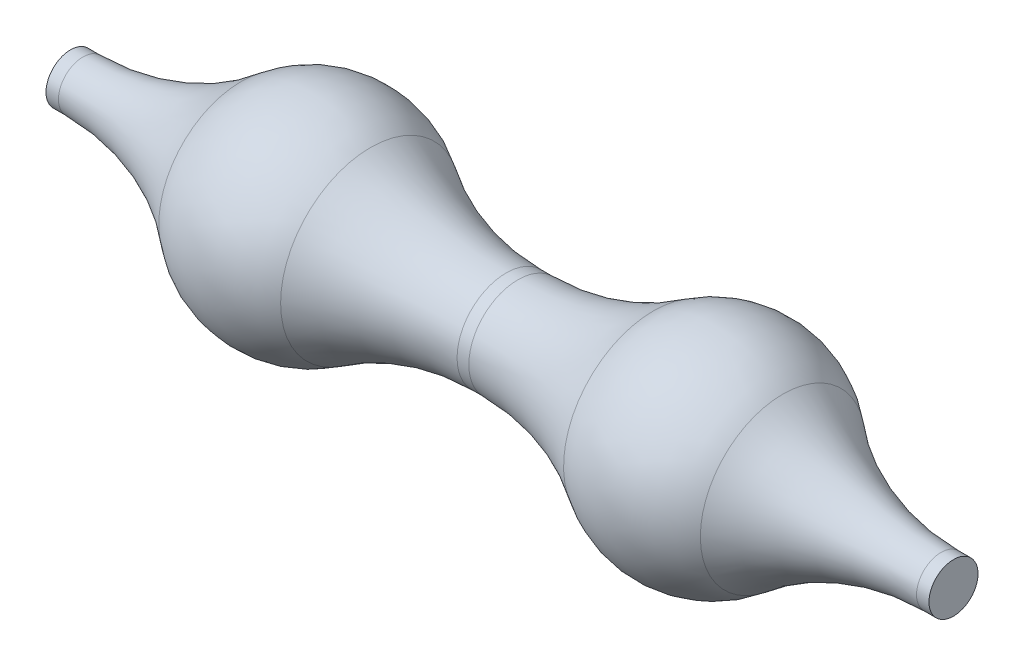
ISO-10303-21;
HEADER;
FILE_DESCRIPTION(('STEP AP214'),'2;1');
FILE_NAME('part.step','',(''),(''),'','','');
FILE_SCHEMA(('AUTOMOTIVE_DESIGN { 1 0 10303 214 1 1 1 1 }'));
ENDSEC;
DATA;
#1=APPLICATION_CONTEXT('core data for automotive mechanical design processes');
#2=APPLICATION_PROTOCOL_DEFINITION('international standard','automotive_design',2000,#1);
#3=PRODUCT_CONTEXT('',#1,'mechanical');
#4=PRODUCT('Part','Part','',(#3));
#5=PRODUCT_RELATED_PRODUCT_CATEGORY('part','',(#4));
#6=PRODUCT_DEFINITION_FORMATION('','',#4);
#7=PRODUCT_DEFINITION_CONTEXT('part definition',#1,'design');
#8=PRODUCT_DEFINITION('design','',#6,#7);
#9=PRODUCT_DEFINITION_SHAPE('','',#8);
#10=(LENGTH_UNIT() NAMED_UNIT(*) SI_UNIT(.MILLI.,.METRE.));
#11=(NAMED_UNIT(*) PLANE_ANGLE_UNIT() SI_UNIT($,.RADIAN.));
#12=(NAMED_UNIT(*) SI_UNIT($,.STERADIAN.) SOLID_ANGLE_UNIT());
#13=UNCERTAINTY_MEASURE_WITH_UNIT(LENGTH_MEASURE(1.E-05),#10,'distance_accuracy_value','');
#14=(GEOMETRIC_REPRESENTATION_CONTEXT(3) GLOBAL_UNCERTAINTY_ASSIGNED_CONTEXT((#13)) GLOBAL_UNIT_ASSIGNED_CONTEXT((#10,
#11,#12)) REPRESENTATION_CONTEXT('',''));
#15=CARTESIAN_POINT('',(0.,0.,0.));
#16=DIRECTION('',(0.,0.,1.));
#17=DIRECTION('',(1.,0.,0.));
#18=AXIS2_PLACEMENT_3D('',#15,#16,#17);
#19=CARTESIAN_POINT('',(7.65,0.,0.));
#20=DIRECTION('',(-1.,0.,0.));
#21=DIRECTION('',(0.,0.,1.));
#22=AXIS2_PLACEMENT_3D('',#19,#20,#21);
#23=PLANE('',#22);
#24=CARTESIAN_POINT('',(7.65,0.,0.));
#25=DIRECTION('',(-1.,0.,0.));
#26=DIRECTION('',(0.,0.,1.));
#27=AXIS2_PLACEMENT_3D('',#24,#25,#26);
#28=CIRCLE('',#27,0.25);
#29=CARTESIAN_POINT('',(7.65,0.,0.25));
#30=VERTEX_POINT('',#29);
#31=EDGE_CURVE('E65',#30,#30,#28,.T.);
#32=ORIENTED_EDGE('',*,*,#31,.F.);
#33=EDGE_LOOP('',(#32));
#34=FACE_BOUND('',#33,.T.);
#35=ADVANCED_FACE('F34',(#34),#23,.F.);
#36=CARTESIAN_POINT('',(-1.35,0.,0.));
#37=DIRECTION('',(-1.,0.,0.));
#38=DIRECTION('',(0.,0.,1.));
#39=AXIS2_PLACEMENT_3D('',#36,#37,#38);
#40=CYLINDRICAL_SURFACE('',#39,0.25);
#41=CARTESIAN_POINT('',(7.52325203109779,0.,0.));
#42=DIRECTION('',(-1.,0.,0.));
#43=DIRECTION('',(0.,0.,1.));
#44=AXIS2_PLACEMENT_3D('',#41,#42,#43);
#45=CIRCLE('',#44,0.25);
#46=CARTESIAN_POINT('',(7.52325203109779,0.,0.25));
#47=VERTEX_POINT('',#46);
#48=EDGE_CURVE('E11',#47,#47,#45,.F.);
#49=ORIENTED_EDGE('',*,*,#48,.T.);
#50=EDGE_LOOP('',(#49));
#51=FACE_BOUND('',#50,.T.);
#52=ORIENTED_EDGE('',*,*,#31,.T.);
#53=EDGE_LOOP('',(#52));
#54=FACE_BOUND('',#53,.T.);
#55=ADVANCED_FACE('F89',(#51,#54),#40,.T.);
#56=CARTESIAN_POINT('',(5.2,0.,0.));
#57=DIRECTION('',(-1.,0.,0.));
#58=DIRECTION('',(0.,1.,0.));
#59=AXIS2_PLACEMENT_3D('',#56,#57,#58);
#60=SPHERICAL_SURFACE('',#59,1.1);
#61=CARTESIAN_POINT('',(4.59195212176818,0.,0.));
#62=DIRECTION('',(1.,0.,0.));
#63=DIRECTION('',(0.,0.,-1.));
#64=AXIS2_PLACEMENT_3D('',#61,#62,#63);
#65=CIRCLE('',#64,0.916666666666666);
#66=CARTESIAN_POINT('',(4.59195212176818,0.916666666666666,0.));
#67=VERTEX_POINT('',#66);
#68=EDGE_CURVE('E40',#67,#67,#65,.T.);
#69=CARTESIAN_POINT('',(5.90988256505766,0.,0.));
#70=DIRECTION('',(-1.,0.,0.));
#71=DIRECTION('',(0.,0.,1.));
#72=AXIS2_PLACEMENT_3D('',#69,#70,#71);
#73=CIRCLE('',#72,0.840277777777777);
#74=CARTESIAN_POINT('',(5.90988256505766,0.840277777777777,0.));
#75=VERTEX_POINT('',#74);
#76=EDGE_CURVE('E44',#75,#75,#73,.T.);
#77=CARTESIAN_POINT('',(4.59195212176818,0.916666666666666,0.));
#78=CARTESIAN_POINT('',(4.60424266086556,0.924819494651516,0.));
#79=CARTESIAN_POINT('',(4.6166973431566,0.932724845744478,0.));
#80=CARTESIAN_POINT('',(4.64191445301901,0.948028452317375,0.));
#81=CARTESIAN_POINT('',(4.65467688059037,0.95542670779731,0.));
#82=CARTESIAN_POINT('',(4.6804889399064,0.969703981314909,0.));
#83=CARTESIAN_POINT('',(4.69353857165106,0.976582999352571,0.));
#84=CARTESIAN_POINT('',(4.71990390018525,0.989810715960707,0.));
#85=CARTESIAN_POINT('',(4.73321959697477,0.996159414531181,0.));
#86=CARTESIAN_POINT('',(4.76009552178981,1.00831620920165,0.));
#87=CARTESIAN_POINT('',(4.77365574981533,1.01412430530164,0.));
#88=CARTESIAN_POINT('',(4.80099879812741,1.02519050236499,0.));
#89=CARTESIAN_POINT('',(4.81478161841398,1.03044860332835,0.));
#90=CARTESIAN_POINT('',(4.84254755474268,1.04040630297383,0.));
#91=CARTESIAN_POINT('',(4.85653067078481,1.04510590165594,0.));
#92=CARTESIAN_POINT('',(4.88467457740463,1.05393899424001,0.));
#93=CARTESIAN_POINT('',(4.89883536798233,1.05807248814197,0.));
#94=CARTESIAN_POINT('',(4.92731171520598,1.06576668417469,0.));
#95=CARTESIAN_POINT('',(4.94162727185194,1.06932738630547,0.));
#96=CARTESIAN_POINT('',(4.97038999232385,1.0758702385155,0.));
#97=CARTESIAN_POINT('',(4.98483715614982,1.07885238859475,0.));
#98=CARTESIAN_POINT('',(5.01383971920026,1.08423331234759,0.));
#99=CARTESIAN_POINT('',(5.02839511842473,1.08663208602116,0.));
#100=CARTESIAN_POINT('',(5.05759060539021,1.09084237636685,0.));
#101=CARTESIAN_POINT('',(5.07223069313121,1.09265389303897,0.));
#102=CARTESIAN_POINT('',(5.10157187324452,1.09568673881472,0.));
#103=CARTESIAN_POINT('',(5.11627296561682,1.09690806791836,0.));
#104=CARTESIAN_POINT('',(5.14571237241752,1.09875856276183,0.));
#105=CARTESIAN_POINT('',(5.16045068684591,1.09938772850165,0.));
#106=CARTESIAN_POINT('',(5.18994069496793,1.10005287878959,0.));
#107=CARTESIAN_POINT('',(5.20469238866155,1.1000888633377,0.));
#108=CARTESIAN_POINT('',(5.23418529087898,1.09956759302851,0.));
#109=CARTESIAN_POINT('',(5.24892649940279,1.0990103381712,0.));
#110=CARTESIAN_POINT('',(5.27837458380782,1.09730349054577,0.));
#111=CARTESIAN_POINT('',(5.29308145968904,1.09615389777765,0.));
#112=CARTESIAN_POINT('',(5.32243708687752,1.09326423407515,0.));
#113=CARTESIAN_POINT('',(5.33708583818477,1.09152416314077,0.));
#114=CARTESIAN_POINT('',(5.36630151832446,1.08745635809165,0.));
#115=CARTESIAN_POINT('',(5.38086844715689,1.08512862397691,0.));
#116=CARTESIAN_POINT('',(5.4098969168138,1.07988925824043,0.));
#117=CARTESIAN_POINT('',(5.42435845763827,1.07697762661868,0.));
#118=CARTESIAN_POINT('',(5.45315275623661,1.07057517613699,0.));
#119=CARTESIAN_POINT('',(5.46748551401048,1.06708435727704,0.));
#120=CARTESIAN_POINT('',(5.49599905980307,1.05952917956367,0.));
#121=CARTESIAN_POINT('',(5.51017984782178,1.05546482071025,0.));
#122=CARTESIAN_POINT('',(5.5383665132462,1.04676913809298,0.));
#123=CARTESIAN_POINT('',(5.55237239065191,1.04213781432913,0.));
#124=CARTESIAN_POINT('',(5.58018657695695,1.03231569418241,0.));
#125=CARTESIAN_POINT('',(5.59399488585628,1.02712489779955,0.));
#126=CARTESIAN_POINT('',(5.62139159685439,1.01619222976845,0.));
#127=CARTESIAN_POINT('',(5.63497999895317,1.01045035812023,0.));
#128=CARTESIAN_POINT('',(5.66191491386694,0.998424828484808,0.));
#129=CARTESIAN_POINT('',(5.67526142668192,0.992141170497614,0.));
#130=CARTESIAN_POINT('',(5.70169097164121,0.979042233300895,0.));
#131=CARTESIAN_POINT('',(5.71477400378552,0.97222695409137,0.));
#132=CARTESIAN_POINT('',(5.74065542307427,0.958075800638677,0.));
#133=CARTESIAN_POINT('',(5.75345381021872,0.95073992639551,0.));
#134=CARTESIAN_POINT('',(5.77874523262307,0.935559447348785,0.));
#135=CARTESIAN_POINT('',(5.79123826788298,0.927714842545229,0.));
#136=CARTESIAN_POINT('',(5.81589878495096,0.911529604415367,0.));
#137=CARTESIAN_POINT('',(5.82806626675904,0.903188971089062,0.));
#138=CARTESIAN_POINT('',(5.85205595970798,0.886025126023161,0.));
#139=CARTESIAN_POINT('',(5.86387817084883,0.877201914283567,0.));
#140=CARTESIAN_POINT('',(5.88715832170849,0.859087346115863,0.));
#141=CARTESIAN_POINT('',(5.89861626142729,0.849795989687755,0.));
#142=CARTESIAN_POINT('',(5.90988256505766,0.840277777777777,0.));
#143=B_SPLINE_CURVE_WITH_KNOTS('',3,(#77,#78,#79,#80,#81,#82,#83,#84,#85,#86,#87,#88,#89,#90,
#91,#92,#93,#94,#95,#96,#97,#98,#99,#100,#101,#102,#103,#104,#105,#106,#107,#108,#109,#110,#111,
#112,#113,#114,#115,#116,#117,#118,#119,#120,#121,#122,#123,#124,#125,#126,#127,#128,#129,#130,
#131,#132,#133,#134,#135,#136,#137,#138,#139,#140,#141,#142),.UNSPECIFIED.,.F.,.F.,(4,2,2,2,2,2,
2,2,2,2,2,2,2,2,2,2,2,2,2,2,2,2,2,2,2,2,2,2,2,2,2,2,4),(0.,0.0442432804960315,
0.0884865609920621,0.132729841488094,0.176973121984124,0.221216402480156,0.265459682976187,
0.309702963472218,0.353946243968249,0.39818952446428,0.442432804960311,0.486676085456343,
0.530919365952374,0.575162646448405,0.619405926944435,0.663649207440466,0.707892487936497,
0.752135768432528,0.79637904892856,0.840622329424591,0.884865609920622,0.929108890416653,
0.973352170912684,1.01759545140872,1.06183873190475,1.10608201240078,1.15032529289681,
1.19456857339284,1.23881185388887,1.2830551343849,1.32729841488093,1.37154169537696,
1.41578497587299),.UNSPECIFIED.);
#144=EDGE_CURVE('BSEAM94',#67,#75,#143,.T.);
#145=ORIENTED_EDGE('',*,*,#68,.T.);
#146=ORIENTED_EDGE('',*,*,#76,.T.);
#147=ORIENTED_EDGE('',*,*,#144,.T.);
#148=ORIENTED_EDGE('',*,*,#144,.F.);
#149=EDGE_LOOP('',(#145,#147,#146,#148));
#150=FACE_BOUND('',#149,.T.);
#151=ADVANCED_FACE('F94',(#150),#60,.T.);
#152=CARTESIAN_POINT('',(-1.35,0.,0.));
#153=DIRECTION('',(-1.,0.,0.));
#154=DIRECTION('',(0.,0.,1.));
#155=AXIS2_PLACEMENT_3D('',#152,#153,#154);
#156=CYLINDRICAL_SURFACE('',#155,0.5);
#157=CARTESIAN_POINT('',(3.21002512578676,0.,0.));
#158=DIRECTION('',(1.,0.,0.));
#159=DIRECTION('',(0.,0.,-1.));
#160=AXIS2_PLACEMENT_3D('',#157,#158,#159);
#161=CIRCLE('',#160,0.5);
#162=CARTESIAN_POINT('',(3.21002512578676,0.,-0.5));
#163=VERTEX_POINT('',#162);
#164=EDGE_CURVE('E48',#163,#163,#161,.F.);
#165=ORIENTED_EDGE('',*,*,#164,.T.);
#166=EDGE_LOOP('',(#165));
#167=FACE_BOUND('',#166,.T.);
#168=CARTESIAN_POINT('',(3.08997487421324,0.,0.));
#169=DIRECTION('',(-1.,0.,0.));
#170=DIRECTION('',(0.,0.,1.));
#171=AXIS2_PLACEMENT_3D('',#168,#169,#170);
#172=CIRCLE('',#171,0.5);
#173=CARTESIAN_POINT('',(3.08997487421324,0.,0.5));
#174=VERTEX_POINT('',#173);
#175=EDGE_CURVE('E53',#174,#174,#172,.F.);
#176=ORIENTED_EDGE('',*,*,#175,.T.);
#177=EDGE_LOOP('',(#176));
#178=FACE_BOUND('',#177,.T.);
#179=ADVANCED_FACE('F85',(#167,#178),#156,.T.);
#180=CARTESIAN_POINT('',(1.1,0.,0.));
#181=DIRECTION('',(-1.,0.,0.));
#182=DIRECTION('',(0.,1.,0.));
#183=AXIS2_PLACEMENT_3D('',#180,#181,#182);
#184=SPHERICAL_SURFACE('',#183,1.1);
#185=CARTESIAN_POINT('',(0.390117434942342,0.,0.));
#186=DIRECTION('',(1.,0.,0.));
#187=DIRECTION('',(0.,0.,-1.));
#188=AXIS2_PLACEMENT_3D('',#185,#186,#187);
#189=CIRCLE('',#188,0.840277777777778);
#190=CARTESIAN_POINT('',(0.390117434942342,0.840277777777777,0.));
#191=VERTEX_POINT('',#190);
#192=EDGE_CURVE('E56',#191,#191,#189,.T.);
#193=CARTESIAN_POINT('',(1.70804787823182,0.,0.));
#194=DIRECTION('',(-1.,0.,0.));
#195=DIRECTION('',(0.,0.,1.));
#196=AXIS2_PLACEMENT_3D('',#193,#194,#195);
#197=CIRCLE('',#196,0.916666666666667);
#198=CARTESIAN_POINT('',(1.70804787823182,0.916666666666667,0.));
#199=VERTEX_POINT('',#198);
#200=EDGE_CURVE('E59',#199,#199,#197,.T.);
#201=CARTESIAN_POINT('',(0.390117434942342,0.840277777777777,0.));
#202=CARTESIAN_POINT('',(0.401383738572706,0.849795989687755,0.));
#203=CARTESIAN_POINT('',(0.412841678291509,0.859087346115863,0.));
#204=CARTESIAN_POINT('',(0.436121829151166,0.877201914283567,0.));
#205=CARTESIAN_POINT('',(0.44794404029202,0.886025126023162,0.));
#206=CARTESIAN_POINT('',(0.471933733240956,0.903188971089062,0.));
#207=CARTESIAN_POINT('',(0.484101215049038,0.911529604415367,0.));
#208=CARTESIAN_POINT('',(0.508761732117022,0.927714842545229,0.));
#209=CARTESIAN_POINT('',(0.521254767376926,0.935559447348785,0.));
#210=CARTESIAN_POINT('',(0.546546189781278,0.95073992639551,0.));
#211=CARTESIAN_POINT('',(0.559344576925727,0.958075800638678,0.));
#212=CARTESIAN_POINT('',(0.585225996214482,0.972226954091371,0.));
#213=CARTESIAN_POINT('',(0.598309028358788,0.979042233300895,0.));
#214=CARTESIAN_POINT('',(0.624738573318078,0.992141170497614,0.));
#215=CARTESIAN_POINT('',(0.638085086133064,0.998424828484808,0.));
#216=CARTESIAN_POINT('',(0.665020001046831,1.01045035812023,0.));
#217=CARTESIAN_POINT('',(0.678608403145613,1.01619222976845,0.));
#218=CARTESIAN_POINT('',(0.706005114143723,1.02712489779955,0.));
#219=CARTESIAN_POINT('',(0.719813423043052,1.03231569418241,0.));
#220=CARTESIAN_POINT('',(0.747627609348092,1.04213781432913,0.));
#221=CARTESIAN_POINT('',(0.761633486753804,1.04676913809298,0.));
#222=CARTESIAN_POINT('',(0.789820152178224,1.05546482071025,0.));
#223=CARTESIAN_POINT('',(0.804000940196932,1.05952917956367,0.));
#224=CARTESIAN_POINT('',(0.832514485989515,1.06708435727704,0.));
#225=CARTESIAN_POINT('',(0.846847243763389,1.07057517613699,0.));
#226=CARTESIAN_POINT('',(0.875641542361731,1.07697762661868,0.));
#227=CARTESIAN_POINT('',(0.8901030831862,1.07988925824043,0.));
#228=CARTESIAN_POINT('',(0.919131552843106,1.08512862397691,0.));
#229=CARTESIAN_POINT('',(0.933698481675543,1.08745635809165,0.));
#230=CARTESIAN_POINT('',(0.96291416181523,1.09152416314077,0.));
#231=CARTESIAN_POINT('',(0.977562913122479,1.09326423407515,0.));
#232=CARTESIAN_POINT('',(1.00691854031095,1.09615389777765,0.));
#233=CARTESIAN_POINT('',(1.02162541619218,1.09730349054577,0.));
#234=CARTESIAN_POINT('',(1.05107350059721,1.0990103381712,0.));
#235=CARTESIAN_POINT('',(1.06581470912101,1.09956759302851,0.));
#236=CARTESIAN_POINT('',(1.09530761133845,1.1000888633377,0.));
#237=CARTESIAN_POINT('',(1.11005930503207,1.10005287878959,0.));
#238=CARTESIAN_POINT('',(1.13954931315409,1.09938772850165,0.));
#239=CARTESIAN_POINT('',(1.15428762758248,1.09875856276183,0.));
#240=CARTESIAN_POINT('',(1.18372703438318,1.09690806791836,0.));
#241=CARTESIAN_POINT('',(1.19842812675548,1.09568673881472,0.));
#242=CARTESIAN_POINT('',(1.22776930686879,1.09265389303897,0.));
#243=CARTESIAN_POINT('',(1.24240939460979,1.09084237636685,0.));
#244=CARTESIAN_POINT('',(1.27160488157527,1.08663208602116,0.));
#245=CARTESIAN_POINT('',(1.28616028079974,1.08423331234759,0.));
#246=CARTESIAN_POINT('',(1.31516284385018,1.07885238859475,0.));
#247=CARTESIAN_POINT('',(1.32961000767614,1.0758702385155,0.));
#248=CARTESIAN_POINT('',(1.35837272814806,1.06932738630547,0.));
#249=CARTESIAN_POINT('',(1.37268828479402,1.06576668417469,0.));
#250=CARTESIAN_POINT('',(1.40116463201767,1.05807248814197,0.));
#251=CARTESIAN_POINT('',(1.41532542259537,1.05393899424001,0.));
#252=CARTESIAN_POINT('',(1.44346932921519,1.04510590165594,0.));
#253=CARTESIAN_POINT('',(1.45745244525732,1.04040630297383,0.));
#254=CARTESIAN_POINT('',(1.48521838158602,1.03044860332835,0.));
#255=CARTESIAN_POINT('',(1.49900120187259,1.02519050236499,0.));
#256=CARTESIAN_POINT('',(1.52634425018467,1.01412430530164,0.));
#257=CARTESIAN_POINT('',(1.53990447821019,1.00831620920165,0.));
#258=CARTESIAN_POINT('',(1.56678040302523,0.996159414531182,0.));
#259=CARTESIAN_POINT('',(1.58009609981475,0.989810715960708,0.));
#260=CARTESIAN_POINT('',(1.60646142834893,0.976582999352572,0.));
#261=CARTESIAN_POINT('',(1.6195110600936,0.969703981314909,0.));
#262=CARTESIAN_POINT('',(1.64532311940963,0.955426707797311,0.));
#263=CARTESIAN_POINT('',(1.65808554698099,0.948028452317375,0.));
#264=CARTESIAN_POINT('',(1.6833026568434,0.932724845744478,0.));
#265=CARTESIAN_POINT('',(1.69575733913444,0.924819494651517,0.));
#266=CARTESIAN_POINT('',(1.70804787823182,0.916666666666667,0.));
#267=B_SPLINE_CURVE_WITH_KNOTS('',3,(#201,#202,#203,#204,#205,#206,#207,#208,#209,#210,#211,
#212,#213,#214,#215,#216,#217,#218,#219,#220,#221,#222,#223,#224,#225,#226,#227,#228,#229,#230,
#231,#232,#233,#234,#235,#236,#237,#238,#239,#240,#241,#242,#243,#244,#245,#246,#247,#248,#249,
#250,#251,#252,#253,#254,#255,#256,#257,#258,#259,#260,#261,#262,#263,#264,#265,#266),
.UNSPECIFIED.,.F.,.F.,(4,2,2,2,2,2,2,2,2,2,2,2,2,2,2,2,2,2,2,2,2,2,2,2,2,2,2,2,2,2,2,2,4),(0.,
0.044243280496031,0.0884865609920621,0.132729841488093,0.176973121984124,0.221216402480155,
0.265459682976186,0.309702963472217,0.353946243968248,0.398189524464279,0.44243280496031,
0.486676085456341,0.530919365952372,0.575162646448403,0.619405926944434,0.663649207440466,
0.707892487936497,0.752135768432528,0.796379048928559,0.84062232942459,0.884865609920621,
0.929108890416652,0.973352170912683,1.01759545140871,1.06183873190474,1.10608201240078,
1.15032529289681,1.19456857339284,1.23881185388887,1.2830551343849,1.32729841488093,
1.37154169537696,1.41578497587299),.UNSPECIFIED.);
#268=EDGE_CURVE('BSEAM76',#191,#199,#267,.T.);
#269=ORIENTED_EDGE('',*,*,#192,.T.);
#270=ORIENTED_EDGE('',*,*,#200,.T.);
#271=ORIENTED_EDGE('',*,*,#268,.T.);
#272=ORIENTED_EDGE('',*,*,#268,.F.);
#273=EDGE_LOOP('',(#269,#271,#270,#272));
#274=FACE_BOUND('',#273,.T.);
#275=ADVANCED_FACE('F76',(#274),#184,.T.);
#276=CARTESIAN_POINT('',(-1.35,0.,0.));
#277=DIRECTION('',(-1.,0.,0.));
#278=DIRECTION('',(0.,0.,1.));
#279=AXIS2_PLACEMENT_3D('',#276,#277,#278);
#280=CYLINDRICAL_SURFACE('',#279,0.25);
#281=CARTESIAN_POINT('',(-1.22325203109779,0.,0.));
#282=DIRECTION('',(1.,0.,0.));
#283=DIRECTION('',(0.,0.,-1.));
#284=AXIS2_PLACEMENT_3D('',#281,#282,#283);
#285=CIRCLE('',#284,0.25);
#286=CARTESIAN_POINT('',(-1.22325203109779,0.,-0.25));
#287=VERTEX_POINT('',#286);
#288=EDGE_CURVE('E62',#287,#287,#285,.F.);
#289=ORIENTED_EDGE('',*,*,#288,.T.);
#290=EDGE_LOOP('',(#289));
#291=FACE_BOUND('',#290,.T.);
#292=CARTESIAN_POINT('',(-1.35,0.,0.));
#293=DIRECTION('',(-1.,0.,0.));
#294=DIRECTION('',(0.,0.,1.));
#295=AXIS2_PLACEMENT_3D('',#292,#293,#294);
#296=CIRCLE('',#295,0.25);
#297=CARTESIAN_POINT('',(-1.35,0.,0.25));
#298=VERTEX_POINT('',#297);
#299=EDGE_CURVE('E68',#298,#298,#296,.T.);
#300=ORIENTED_EDGE('',*,*,#299,.F.);
#301=EDGE_LOOP('',(#300));
#302=FACE_BOUND('',#301,.T.);
#303=ADVANCED_FACE('F74',(#291,#302),#280,.T.);
#304=CARTESIAN_POINT('',(-1.35,0.,0.));
#305=DIRECTION('',(1.,0.,0.));
#306=DIRECTION('',(0.,0.,-1.));
#307=AXIS2_PLACEMENT_3D('',#304,#305,#306);
#308=PLANE('',#307);
#309=ORIENTED_EDGE('',*,*,#299,.T.);
#310=EDGE_LOOP('',(#309));
#311=FACE_BOUND('',#310,.T.);
#312=ADVANCED_FACE('F72',(#311),#308,.F.);
#313=CARTESIAN_POINT('',(-1.22325203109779,0.,0.));
#314=DIRECTION('',(1.,0.,0.));
#315=DIRECTION('',(0.,0.,-1.));
#316=AXIS2_PLACEMENT_3D('',#313,#314,#315);
#317=TOROIDAL_SURFACE('',#316,2.75,2.5);
#318=ORIENTED_EDGE('',*,*,#192,.F.);
#319=EDGE_LOOP('',(#318));
#320=FACE_BOUND('',#319,.T.);
#321=ORIENTED_EDGE('',*,*,#288,.F.);
#322=EDGE_LOOP('',(#321));
#323=FACE_BOUND('',#322,.T.);
#324=ADVANCED_FACE('F83',(#320,#323),#317,.F.);
#325=CARTESIAN_POINT('',(3.21002512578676,0.,0.));
#326=DIRECTION('',(1.,0.,0.));
#327=DIRECTION('',(0.,0.,-1.));
#328=AXIS2_PLACEMENT_3D('',#325,#326,#327);
#329=TOROIDAL_SURFACE('',#328,3.,2.5);
#330=ORIENTED_EDGE('',*,*,#68,.F.);
#331=EDGE_LOOP('',(#330));
#332=FACE_BOUND('',#331,.T.);
#333=ORIENTED_EDGE('',*,*,#164,.F.);
#334=EDGE_LOOP('',(#333));
#335=FACE_BOUND('',#334,.T.);
#336=ADVANCED_FACE('F120',(#332,#335),#329,.F.);
#337=CARTESIAN_POINT('',(7.52325203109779,0.,0.));
#338=DIRECTION('',(-1.,0.,0.));
#339=DIRECTION('',(0.,0.,1.));
#340=AXIS2_PLACEMENT_3D('',#337,#338,#339);
#341=TOROIDAL_SURFACE('',#340,2.75,2.5);
#342=ORIENTED_EDGE('',*,*,#48,.F.);
#343=EDGE_LOOP('',(#342));
#344=FACE_BOUND('',#343,.T.);
#345=ORIENTED_EDGE('',*,*,#76,.F.);
#346=EDGE_LOOP('',(#345));
#347=FACE_BOUND('',#346,.T.);
#348=ADVANCED_FACE('F113',(#344,#347),#341,.F.);
#349=CARTESIAN_POINT('',(3.08997487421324,0.,0.));
#350=DIRECTION('',(-1.,0.,0.));
#351=DIRECTION('',(0.,0.,1.));
#352=AXIS2_PLACEMENT_3D('',#349,#350,#351);
#353=TOROIDAL_SURFACE('',#352,3.,2.5);
#354=ORIENTED_EDGE('',*,*,#175,.F.);
#355=EDGE_LOOP('',(#354));
#356=FACE_BOUND('',#355,.T.);
#357=ORIENTED_EDGE('',*,*,#200,.F.);
#358=EDGE_LOOP('',(#357));
#359=FACE_BOUND('',#358,.T.);
#360=ADVANCED_FACE('F110',(#356,#359),#353,.F.);
#361=CLOSED_SHELL('',(#35,#55,#151,#179,#275,#303,#312,#324,#336,#348,#360));
#362=MANIFOLD_SOLID_BREP('B2',#361);
#363=ADVANCED_BREP_SHAPE_REPRESENTATION('',(#18,#362),#14);
#364=SHAPE_DEFINITION_REPRESENTATION(#9,#363);
ENDSEC;
END-ISO-10303-21;
